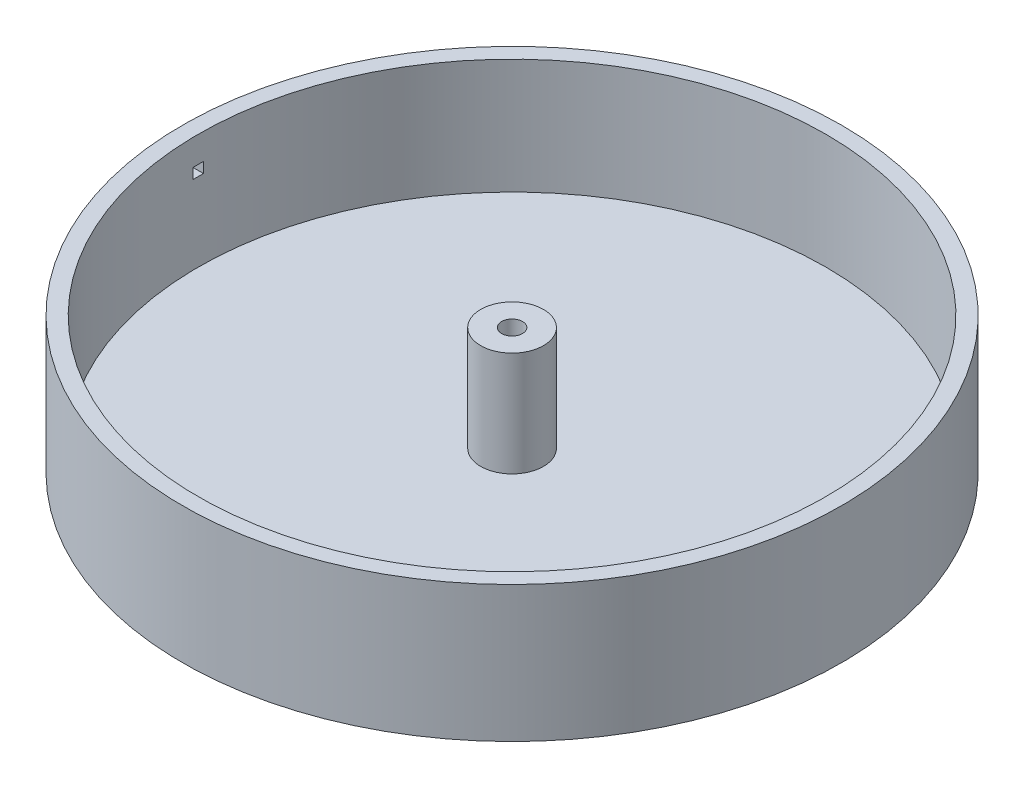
ISO-10303-21;
HEADER;
FILE_DESCRIPTION(('STEP AP214'),'2;1');
FILE_NAME('part.step','',(''),(''),'','','');
FILE_SCHEMA(('AUTOMOTIVE_DESIGN { 1 0 10303 214 1 1 1 1 }'));
ENDSEC;
DATA;
#1=APPLICATION_CONTEXT('core data for automotive mechanical design processes');
#2=APPLICATION_PROTOCOL_DEFINITION('international standard','automotive_design',2000,#1);
#3=PRODUCT_CONTEXT('',#1,'mechanical');
#4=PRODUCT('Part','Part','',(#3));
#5=PRODUCT_RELATED_PRODUCT_CATEGORY('part','',(#4));
#6=PRODUCT_DEFINITION_FORMATION('','',#4);
#7=PRODUCT_DEFINITION_CONTEXT('part definition',#1,'design');
#8=PRODUCT_DEFINITION('design','',#6,#7);
#9=PRODUCT_DEFINITION_SHAPE('','',#8);
#10=(LENGTH_UNIT() NAMED_UNIT(*) SI_UNIT(.MILLI.,.METRE.));
#11=(NAMED_UNIT(*) PLANE_ANGLE_UNIT() SI_UNIT($,.RADIAN.));
#12=(NAMED_UNIT(*) SI_UNIT($,.STERADIAN.) SOLID_ANGLE_UNIT());
#13=UNCERTAINTY_MEASURE_WITH_UNIT(LENGTH_MEASURE(1.E-05),#10,'distance_accuracy_value','');
#14=(GEOMETRIC_REPRESENTATION_CONTEXT(3) GLOBAL_UNCERTAINTY_ASSIGNED_CONTEXT((#13)) GLOBAL_UNIT_ASSIGNED_CONTEXT((#10,
#11,#12)) REPRESENTATION_CONTEXT('',''));
#15=CARTESIAN_POINT('',(0.,0.,0.));
#16=DIRECTION('',(0.,0.,1.));
#17=DIRECTION('',(1.,0.,0.));
#18=AXIS2_PLACEMENT_3D('',#15,#16,#17);
#19=CARTESIAN_POINT('',(-19.05,76.2,0.));
#20=DIRECTION('',(0.,-1.,0.));
#21=DIRECTION('',(0.,0.,-1.));
#22=AXIS2_PLACEMENT_3D('',#19,#20,#21);
#23=PLANE('',#22);
#24=CARTESIAN_POINT('',(0.,76.2,0.));
#25=DIRECTION('',(0.,-1.,0.));
#26=DIRECTION('',(0.,0.,-1.));
#27=AXIS2_PLACEMENT_3D('',#24,#25,#26);
#28=CIRCLE('',#27,19.05);
#29=CARTESIAN_POINT('',(0.,76.2,-19.05));
#30=VERTEX_POINT('',#29);
#31=EDGE_CURVE('E91',#30,#30,#28,.T.);
#32=ORIENTED_EDGE('',*,*,#31,.F.);
#33=EDGE_LOOP('',(#32));
#34=FACE_BOUND('',#33,.T.);
#35=CARTESIAN_POINT('',(0.,76.2,0.));
#36=DIRECTION('',(0.,-1.,0.));
#37=DIRECTION('',(0.,0.,-1.));
#38=AXIS2_PLACEMENT_3D('',#35,#36,#37);
#39=CIRCLE('',#38,6.35);
#40=CARTESIAN_POINT('',(0.,76.2,-6.35));
#41=VERTEX_POINT('',#40);
#42=EDGE_CURVE('E116',#41,#41,#39,.T.);
#43=ORIENTED_EDGE('',*,*,#42,.T.);
#44=EDGE_LOOP('',(#43));
#45=FACE_BOUND('',#44,.T.);
#46=ADVANCED_FACE('F35',(#34,#45),#23,.F.);
#47=CARTESIAN_POINT('',(0.,0.,0.));
#48=DIRECTION('',(0.,-1.,0.));
#49=DIRECTION('',(0.,0.,-1.));
#50=AXIS2_PLACEMENT_3D('',#47,#48,#49);
#51=CYLINDRICAL_SURFACE('',#50,6.35);
#52=ORIENTED_EDGE('',*,*,#42,.F.);
#53=EDGE_LOOP('',(#52));
#54=FACE_BOUND('',#53,.T.);
#55=CARTESIAN_POINT('',(0.,0.,0.));
#56=DIRECTION('',(0.,-1.,0.));
#57=DIRECTION('',(0.,0.,-1.));
#58=AXIS2_PLACEMENT_3D('',#55,#56,#57);
#59=CIRCLE('',#58,6.34999999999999);
#60=CARTESIAN_POINT('',(0.,0.,-6.34999999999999));
#61=VERTEX_POINT('',#60);
#62=EDGE_CURVE('E113',#61,#61,#59,.T.);
#63=ORIENTED_EDGE('',*,*,#62,.T.);
#64=EDGE_LOOP('',(#63));
#65=FACE_BOUND('',#64,.T.);
#66=ADVANCED_FACE('F146',(#54,#65),#51,.F.);
#67=CARTESIAN_POINT('',(-6.34999999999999,0.,0.));
#68=DIRECTION('',(0.,1.,0.));
#69=DIRECTION('',(0.,0.,1.));
#70=AXIS2_PLACEMENT_3D('',#67,#68,#69);
#71=PLANE('',#70);
#72=ORIENTED_EDGE('',*,*,#62,.F.);
#73=EDGE_LOOP('',(#72));
#74=FACE_BOUND('',#73,.T.);
#75=CARTESIAN_POINT('',(0.,0.,0.));
#76=DIRECTION('',(0.,-1.,0.));
#77=DIRECTION('',(0.,0.,-1.));
#78=AXIS2_PLACEMENT_3D('',#75,#76,#77);
#79=CIRCLE('',#78,200.025);
#80=CARTESIAN_POINT('',(0.,0.,-200.025));
#81=VERTEX_POINT('',#80);
#82=EDGE_CURVE('E110',#81,#81,#79,.T.);
#83=ORIENTED_EDGE('',*,*,#82,.T.);
#84=EDGE_LOOP('',(#83));
#85=FACE_BOUND('',#84,.T.);
#86=ADVANCED_FACE('F151',(#74,#85),#71,.F.);
#87=CARTESIAN_POINT('',(0.,0.,0.));
#88=DIRECTION('',(0.,-1.,0.));
#89=DIRECTION('',(0.,0.,-1.));
#90=AXIS2_PLACEMENT_3D('',#87,#88,#89);
#91=CYLINDRICAL_SURFACE('',#90,200.025);
#92=DIRECTION('',(0.,-1.,0.));
#93=VECTOR('',#92,1.);
#94=CARTESIAN_POINT('',(-199.9997999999,0.,-3.175));
#95=LINE('',#94,#93);
#96=CARTESIAN_POINT('',(-199.9997999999,60.325,-3.17499999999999));
#97=VERTEX_POINT('',#96);
#98=CARTESIAN_POINT('',(-199.9997999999,66.675,-3.17499999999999));
#99=VERTEX_POINT('',#98);
#100=EDGE_CURVE('E84',#97,#99,#95,.F.);
#101=ORIENTED_EDGE('',*,*,#100,.T.);
#102=CARTESIAN_POINT('',(0.,66.675,0.));
#103=DIRECTION('',(0.,1.,0.));
#104=DIRECTION('',(0.,0.,1.));
#105=AXIS2_PLACEMENT_3D('',#102,#103,#104);
#106=CIRCLE('',#105,200.025);
#107=CARTESIAN_POINT('',(-199.9997999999,66.675,3.17500000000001));
#108=VERTEX_POINT('',#107);
#109=EDGE_CURVE('E49',#99,#108,#106,.T.);
#110=ORIENTED_EDGE('',*,*,#109,.T.);
#111=DIRECTION('',(0.,-1.,0.));
#112=VECTOR('',#111,1.);
#113=CARTESIAN_POINT('',(-199.9997999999,0.,3.175));
#114=LINE('',#113,#112);
#115=CARTESIAN_POINT('',(-199.9997999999,60.325,3.17500000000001));
#116=VERTEX_POINT('',#115);
#117=EDGE_CURVE('E77',#108,#116,#114,.T.);
#118=ORIENTED_EDGE('',*,*,#117,.T.);
#119=CARTESIAN_POINT('',(0.,60.325,0.));
#120=DIRECTION('',(0.,-1.,0.));
#121=DIRECTION('',(0.,0.,-1.));
#122=AXIS2_PLACEMENT_3D('',#119,#120,#121);
#123=CIRCLE('',#122,200.025);
#124=EDGE_CURVE('E90',#116,#97,#123,.T.);
#125=ORIENTED_EDGE('',*,*,#124,.T.);
#126=EDGE_LOOP('',(#101,#110,#118,#125));
#127=FACE_BOUND('',#126,.T.);
#128=ORIENTED_EDGE('',*,*,#82,.F.);
#129=EDGE_LOOP('',(#128));
#130=FACE_BOUND('',#129,.T.);
#131=CARTESIAN_POINT('',(0.,82.55,0.));
#132=DIRECTION('',(0.,-1.,0.));
#133=DIRECTION('',(0.,0.,-1.));
#134=AXIS2_PLACEMENT_3D('',#131,#132,#133);
#135=CIRCLE('',#134,200.025);
#136=CARTESIAN_POINT('',(0.,82.55,-200.025));
#137=VERTEX_POINT('',#136);
#138=EDGE_CURVE('E107',#137,#137,#135,.T.);
#139=ORIENTED_EDGE('',*,*,#138,.T.);
#140=EDGE_LOOP('',(#139));
#141=FACE_BOUND('',#140,.T.);
#142=ADVANCED_FACE('F88',(#127,#130,#141),#91,.T.);
#143=CARTESIAN_POINT('',(-200.025,82.55,0.));
#144=DIRECTION('',(0.,-1.,0.));
#145=DIRECTION('',(0.,0.,-1.));
#146=AXIS2_PLACEMENT_3D('',#143,#144,#145);
#147=PLANE('',#146);
#148=ORIENTED_EDGE('',*,*,#138,.F.);
#149=EDGE_LOOP('',(#148));
#150=FACE_BOUND('',#149,.T.);
#151=CARTESIAN_POINT('',(0.,82.55,0.));
#152=DIRECTION('',(0.,-1.,0.));
#153=DIRECTION('',(0.,0.,-1.));
#154=AXIS2_PLACEMENT_3D('',#151,#152,#153);
#155=CIRCLE('',#154,190.5);
#156=CARTESIAN_POINT('',(0.,82.55,-190.5));
#157=VERTEX_POINT('',#156);
#158=EDGE_CURVE('E104',#157,#157,#155,.T.);
#159=ORIENTED_EDGE('',*,*,#158,.T.);
#160=EDGE_LOOP('',(#159));
#161=FACE_BOUND('',#160,.T.);
#162=ADVANCED_FACE('F165',(#150,#161),#147,.F.);
#163=CARTESIAN_POINT('',(0.,0.,0.));
#164=DIRECTION('',(0.,-1.,0.));
#165=DIRECTION('',(0.,0.,-1.));
#166=AXIS2_PLACEMENT_3D('',#163,#164,#165);
#167=CYLINDRICAL_SURFACE('',#166,190.5);
#168=CARTESIAN_POINT('',(0.,66.675,0.));
#169=DIRECTION('',(0.,1.,0.));
#170=DIRECTION('',(0.,0.,1.));
#171=AXIS2_PLACEMENT_3D('',#168,#169,#170);
#172=CIRCLE('',#171,190.5);
#173=CARTESIAN_POINT('',(-190.473539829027,66.675,3.17500000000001));
#174=VERTEX_POINT('',#173);
#175=CARTESIAN_POINT('',(-190.473539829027,66.675,-3.17499999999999));
#176=VERTEX_POINT('',#175);
#177=EDGE_CURVE('E119',#174,#176,#172,.F.);
#178=ORIENTED_EDGE('',*,*,#177,.T.);
#179=DIRECTION('',(0.,-1.,0.));
#180=VECTOR('',#179,1.);
#181=CARTESIAN_POINT('',(-190.473539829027,0.,-3.175));
#182=LINE('',#181,#180);
#183=CARTESIAN_POINT('',(-190.473539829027,60.325,-3.17499999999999));
#184=VERTEX_POINT('',#183);
#185=EDGE_CURVE('E11',#176,#184,#182,.T.);
#186=ORIENTED_EDGE('',*,*,#185,.T.);
#187=CARTESIAN_POINT('',(0.,60.325,0.));
#188=DIRECTION('',(0.,-1.,0.));
#189=DIRECTION('',(0.,0.,-1.));
#190=AXIS2_PLACEMENT_3D('',#187,#188,#189);
#191=CIRCLE('',#190,190.5);
#192=CARTESIAN_POINT('',(-190.473539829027,60.325,3.17500000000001));
#193=VERTEX_POINT('',#192);
#194=EDGE_CURVE('E42',#184,#193,#191,.F.);
#195=ORIENTED_EDGE('',*,*,#194,.T.);
#196=DIRECTION('',(0.,-1.,0.));
#197=VECTOR('',#196,1.);
#198=CARTESIAN_POINT('',(-190.473539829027,0.,3.175));
#199=LINE('',#198,#197);
#200=EDGE_CURVE('E121',#193,#174,#199,.F.);
#201=ORIENTED_EDGE('',*,*,#200,.T.);
#202=EDGE_LOOP('',(#178,#186,#195,#201));
#203=FACE_BOUND('',#202,.T.);
#204=ORIENTED_EDGE('',*,*,#158,.F.);
#205=EDGE_LOOP('',(#204));
#206=FACE_BOUND('',#205,.T.);
#207=CARTESIAN_POINT('',(0.,12.7,0.));
#208=DIRECTION('',(0.,-1.,0.));
#209=DIRECTION('',(0.,0.,-1.));
#210=AXIS2_PLACEMENT_3D('',#207,#208,#209);
#211=CIRCLE('',#210,190.5);
#212=CARTESIAN_POINT('',(0.,12.7,-190.5));
#213=VERTEX_POINT('',#212);
#214=EDGE_CURVE('E101',#213,#213,#211,.T.);
#215=ORIENTED_EDGE('',*,*,#214,.T.);
#216=EDGE_LOOP('',(#215));
#217=FACE_BOUND('',#216,.T.);
#218=ADVANCED_FACE('F125',(#203,#206,#217),#167,.F.);
#219=CARTESIAN_POINT('',(-190.5,12.7,0.));
#220=DIRECTION('',(0.,-1.,0.));
#221=DIRECTION('',(0.,0.,-1.));
#222=AXIS2_PLACEMENT_3D('',#219,#220,#221);
#223=PLANE('',#222);
#224=ORIENTED_EDGE('',*,*,#214,.F.);
#225=EDGE_LOOP('',(#224));
#226=FACE_BOUND('',#225,.T.);
#227=CARTESIAN_POINT('',(0.,12.7,0.));
#228=DIRECTION('',(0.,-1.,0.));
#229=DIRECTION('',(0.,0.,-1.));
#230=AXIS2_PLACEMENT_3D('',#227,#228,#229);
#231=CIRCLE('',#230,19.05);
#232=CARTESIAN_POINT('',(0.,12.7,-19.05));
#233=VERTEX_POINT('',#232);
#234=EDGE_CURVE('E94',#233,#233,#231,.T.);
#235=ORIENTED_EDGE('',*,*,#234,.T.);
#236=EDGE_LOOP('',(#235));
#237=FACE_BOUND('',#236,.T.);
#238=ADVANCED_FACE('F175',(#226,#237),#223,.F.);
#239=CARTESIAN_POINT('',(0.,0.,0.));
#240=DIRECTION('',(0.,-1.,0.));
#241=DIRECTION('',(0.,0.,-1.));
#242=AXIS2_PLACEMENT_3D('',#239,#240,#241);
#243=CYLINDRICAL_SURFACE('',#242,19.05);
#244=ORIENTED_EDGE('',*,*,#234,.F.);
#245=EDGE_LOOP('',(#244));
#246=FACE_BOUND('',#245,.T.);
#247=ORIENTED_EDGE('',*,*,#31,.T.);
#248=EDGE_LOOP('',(#247));
#249=FACE_BOUND('',#248,.T.);
#250=ADVANCED_FACE('F181',(#246,#249),#243,.T.);
#251=CARTESIAN_POINT('',(-200.025,66.675,-3.17499999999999));
#252=DIRECTION('',(0.,0.,-1.));
#253=DIRECTION('',(0.,1.,0.));
#254=AXIS2_PLACEMENT_3D('',#251,#252,#253);
#255=PLANE('',#254);
#256=DIRECTION('',(1.,0.,0.));
#257=VECTOR('',#256,1.);
#258=CARTESIAN_POINT('',(-200.025,60.325,-3.17499999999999));
#259=LINE('',#258,#257);
#260=EDGE_CURVE('E78',#97,#184,#259,.T.);
#261=ORIENTED_EDGE('',*,*,#260,.T.);
#262=ORIENTED_EDGE('',*,*,#185,.F.);
#263=DIRECTION('',(1.,0.,0.));
#264=VECTOR('',#263,1.);
#265=CARTESIAN_POINT('',(-200.025,66.675,-3.17499999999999));
#266=LINE('',#265,#264);
#267=EDGE_CURVE('E56',#99,#176,#266,.T.);
#268=ORIENTED_EDGE('',*,*,#267,.F.);
#269=ORIENTED_EDGE('',*,*,#100,.F.);
#270=EDGE_LOOP('',(#261,#262,#268,#269));
#271=FACE_BOUND('',#270,.T.);
#272=ADVANCED_FACE('F83',(#271),#255,.F.);
#273=CARTESIAN_POINT('',(-200.025,60.325,3.17500000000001));
#274=DIRECTION('',(0.,-1.,0.));
#275=DIRECTION('',(0.,0.,-1.));
#276=AXIS2_PLACEMENT_3D('',#273,#274,#275);
#277=PLANE('',#276);
#278=DIRECTION('',(1.,0.,0.));
#279=VECTOR('',#278,1.);
#280=CARTESIAN_POINT('',(-200.025,60.325,3.17500000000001));
#281=LINE('',#280,#279);
#282=EDGE_CURVE('E131',#116,#193,#281,.T.);
#283=ORIENTED_EDGE('',*,*,#282,.T.);
#284=ORIENTED_EDGE('',*,*,#194,.F.);
#285=ORIENTED_EDGE('',*,*,#260,.F.);
#286=ORIENTED_EDGE('',*,*,#124,.F.);
#287=EDGE_LOOP('',(#283,#284,#285,#286));
#288=FACE_BOUND('',#287,.T.);
#289=ADVANCED_FACE('F129',(#288),#277,.F.);
#290=CARTESIAN_POINT('',(-200.025,66.675,3.17500000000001));
#291=DIRECTION('',(0.,0.,1.));
#292=DIRECTION('',(0.,-1.,0.));
#293=AXIS2_PLACEMENT_3D('',#290,#291,#292);
#294=PLANE('',#293);
#295=DIRECTION('',(1.,0.,0.));
#296=VECTOR('',#295,1.);
#297=CARTESIAN_POINT('',(-200.025,66.675,3.17500000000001));
#298=LINE('',#297,#296);
#299=EDGE_CURVE('E75',#108,#174,#298,.T.);
#300=ORIENTED_EDGE('',*,*,#299,.T.);
#301=ORIENTED_EDGE('',*,*,#200,.F.);
#302=ORIENTED_EDGE('',*,*,#282,.F.);
#303=ORIENTED_EDGE('',*,*,#117,.F.);
#304=EDGE_LOOP('',(#300,#301,#302,#303));
#305=FACE_BOUND('',#304,.T.);
#306=ADVANCED_FACE('F136',(#305),#294,.F.);
#307=CARTESIAN_POINT('',(-200.025,66.675,3.17500000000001));
#308=DIRECTION('',(0.,1.,0.));
#309=DIRECTION('',(0.,0.,1.));
#310=AXIS2_PLACEMENT_3D('',#307,#308,#309);
#311=PLANE('',#310);
#312=ORIENTED_EDGE('',*,*,#267,.T.);
#313=ORIENTED_EDGE('',*,*,#177,.F.);
#314=ORIENTED_EDGE('',*,*,#299,.F.);
#315=ORIENTED_EDGE('',*,*,#109,.F.);
#316=EDGE_LOOP('',(#312,#313,#314,#315));
#317=FACE_BOUND('',#316,.T.);
#318=ADVANCED_FACE('F73',(#317),#311,.F.);
#319=CLOSED_SHELL('',(#46,#66,#86,#142,#162,#218,#238,#250,#272,#289,#306,#318));
#320=MANIFOLD_SOLID_BREP('B2',#319);
#321=ADVANCED_BREP_SHAPE_REPRESENTATION('',(#18,#320),#14);
#322=SHAPE_DEFINITION_REPRESENTATION(#9,#321);
ENDSEC;
END-ISO-10303-21;
